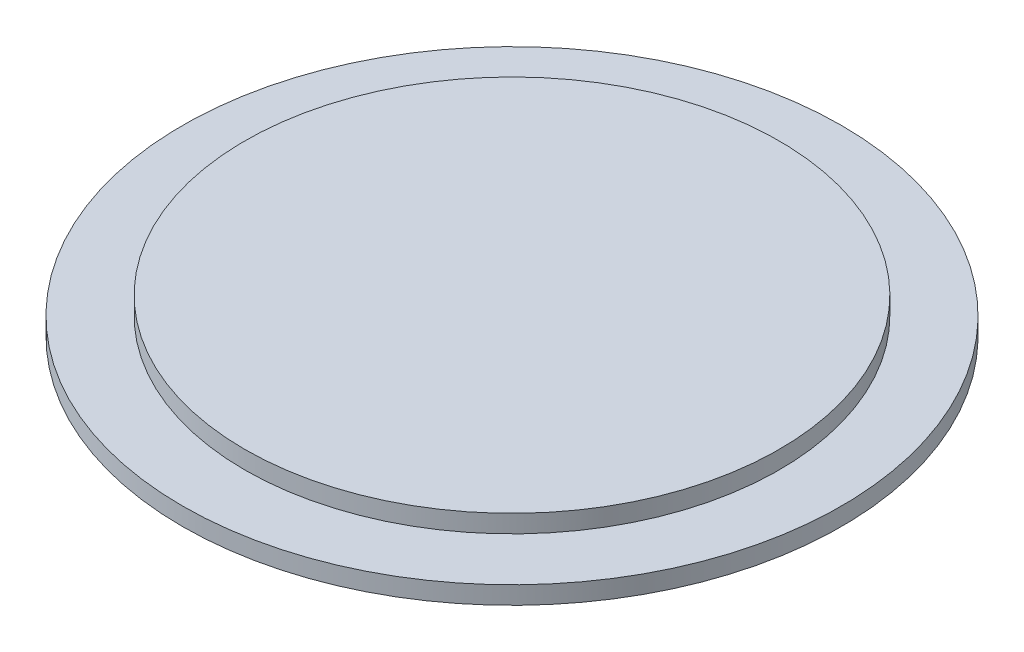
from build123d import *


with BuildPart() as part:
    # Esquisse1 → Base-R_volution (revolve)
    with BuildSketch(Plane.XY, mode=Mode.PRIVATE) as base_r_volution_sk:
        Polygon((0, 0), (18.5, 0), (18.5, 1), (15, 1), (15, 2), (0, 2), align=None)
    revolve(base_r_volution_sk.sketch.rotate(Axis((0, 18.79213198, 0), (0, -1, 0)), 90), axis=Axis((0, 18.79213198, 0), (0, -1, 0)))


solid = part.part
